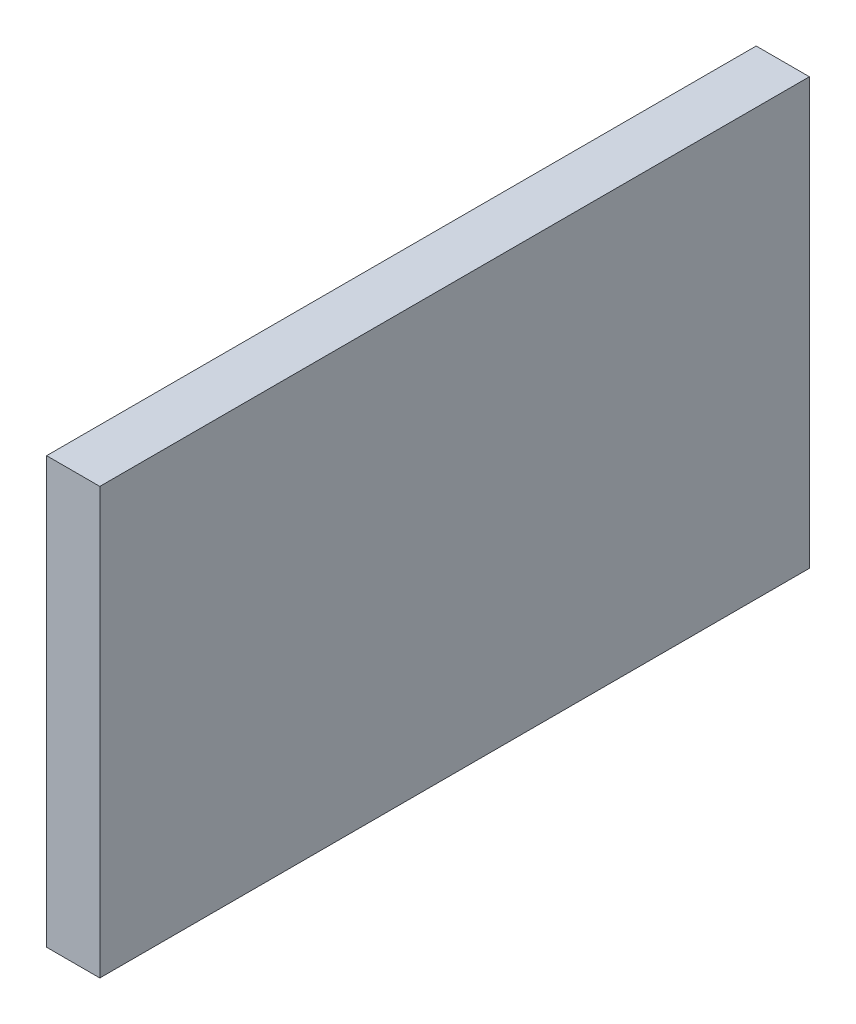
ISO-10303-21;
HEADER;
FILE_DESCRIPTION(('STEP AP214'),'2;1');
FILE_NAME('part.step','',(''),(''),'','','');
FILE_SCHEMA(('AUTOMOTIVE_DESIGN { 1 0 10303 214 1 1 1 1 }'));
ENDSEC;
DATA;
#1=APPLICATION_CONTEXT('core data for automotive mechanical design processes');
#2=APPLICATION_PROTOCOL_DEFINITION('international standard','automotive_design',2000,#1);
#3=PRODUCT_CONTEXT('',#1,'mechanical');
#4=PRODUCT('Part','Part','',(#3));
#5=PRODUCT_RELATED_PRODUCT_CATEGORY('part','',(#4));
#6=PRODUCT_DEFINITION_FORMATION('','',#4);
#7=PRODUCT_DEFINITION_CONTEXT('part definition',#1,'design');
#8=PRODUCT_DEFINITION('design','',#6,#7);
#9=PRODUCT_DEFINITION_SHAPE('','',#8);
#10=(LENGTH_UNIT() NAMED_UNIT(*) SI_UNIT(.MILLI.,.METRE.));
#11=(NAMED_UNIT(*) PLANE_ANGLE_UNIT() SI_UNIT($,.RADIAN.));
#12=(NAMED_UNIT(*) SI_UNIT($,.STERADIAN.) SOLID_ANGLE_UNIT());
#13=UNCERTAINTY_MEASURE_WITH_UNIT(LENGTH_MEASURE(1.E-05),#10,'distance_accuracy_value','');
#14=(GEOMETRIC_REPRESENTATION_CONTEXT(3) GLOBAL_UNCERTAINTY_ASSIGNED_CONTEXT((#13)) GLOBAL_UNIT_ASSIGNED_CONTEXT((#10,
#11,#12)) REPRESENTATION_CONTEXT('',''));
#15=CARTESIAN_POINT('',(0.,0.,0.));
#16=DIRECTION('',(0.,0.,1.));
#17=DIRECTION('',(1.,0.,0.));
#18=AXIS2_PLACEMENT_3D('',#15,#16,#17);
#19=CARTESIAN_POINT('',(15.,-120.,-200.));
#20=DIRECTION('',(0.,0.,1.));
#21=DIRECTION('',(1.,0.,0.));
#22=AXIS2_PLACEMENT_3D('',#19,#20,#21);
#23=PLANE('',#22);
#24=DIRECTION('',(0.,1.,0.));
#25=VECTOR('',#24,1.);
#26=CARTESIAN_POINT('',(-15.,-120.,-200.));
#27=LINE('',#26,#25);
#28=CARTESIAN_POINT('',(-15.,-120.,-200.));
#29=VERTEX_POINT('',#28);
#30=CARTESIAN_POINT('',(-15.,120.,-200.));
#31=VERTEX_POINT('',#30);
#32=EDGE_CURVE('E95',#29,#31,#27,.T.);
#33=ORIENTED_EDGE('',*,*,#32,.T.);
#34=DIRECTION('',(-1.,0.,0.));
#35=VECTOR('',#34,1.);
#36=CARTESIAN_POINT('',(15.,120.,-200.));
#37=LINE('',#36,#35);
#38=CARTESIAN_POINT('',(15.,120.,-200.));
#39=VERTEX_POINT('',#38);
#40=EDGE_CURVE('E11',#39,#31,#37,.T.);
#41=ORIENTED_EDGE('',*,*,#40,.F.);
#42=DIRECTION('',(0.,1.,0.));
#43=VECTOR('',#42,1.);
#44=CARTESIAN_POINT('',(15.,-120.,-200.));
#45=LINE('',#44,#43);
#46=CARTESIAN_POINT('',(15.,-120.,-200.));
#47=VERTEX_POINT('',#46);
#48=EDGE_CURVE('E83',#47,#39,#45,.T.);
#49=ORIENTED_EDGE('',*,*,#48,.F.);
#50=DIRECTION('',(-1.,0.,0.));
#51=VECTOR('',#50,1.);
#52=CARTESIAN_POINT('',(15.,-120.,-200.));
#53=LINE('',#52,#51);
#54=EDGE_CURVE('E91',#47,#29,#53,.T.);
#55=ORIENTED_EDGE('',*,*,#54,.T.);
#56=EDGE_LOOP('',(#33,#41,#49,#55));
#57=FACE_BOUND('',#56,.T.);
#58=ADVANCED_FACE('F32',(#57),#23,.F.);
#59=CARTESIAN_POINT('',(15.,120.,200.));
#60=DIRECTION('',(0.,-1.,0.));
#61=DIRECTION('',(0.,0.,-1.));
#62=AXIS2_PLACEMENT_3D('',#59,#60,#61);
#63=PLANE('',#62);
#64=DIRECTION('',(0.,0.,1.));
#65=VECTOR('',#64,1.);
#66=CARTESIAN_POINT('',(-15.,120.,200.));
#67=LINE('',#66,#65);
#68=CARTESIAN_POINT('',(-15.,120.,200.));
#69=VERTEX_POINT('',#68);
#70=EDGE_CURVE('E87',#31,#69,#67,.T.);
#71=ORIENTED_EDGE('',*,*,#70,.T.);
#72=DIRECTION('',(-1.,0.,0.));
#73=VECTOR('',#72,1.);
#74=CARTESIAN_POINT('',(15.,120.,200.));
#75=LINE('',#74,#73);
#76=CARTESIAN_POINT('',(15.,120.,200.));
#77=VERTEX_POINT('',#76);
#78=EDGE_CURVE('E40',#77,#69,#75,.T.);
#79=ORIENTED_EDGE('',*,*,#78,.F.);
#80=DIRECTION('',(0.,0.,1.));
#81=VECTOR('',#80,1.);
#82=CARTESIAN_POINT('',(15.,120.,200.));
#83=LINE('',#82,#81);
#84=EDGE_CURVE('E78',#39,#77,#83,.T.);
#85=ORIENTED_EDGE('',*,*,#84,.F.);
#86=ORIENTED_EDGE('',*,*,#40,.T.);
#87=EDGE_LOOP('',(#71,#79,#85,#86));
#88=FACE_BOUND('',#87,.T.);
#89=ADVANCED_FACE('F86',(#88),#63,.F.);
#90=CARTESIAN_POINT('',(15.,-120.,200.));
#91=DIRECTION('',(0.,0.,-1.));
#92=DIRECTION('',(-1.,0.,0.));
#93=AXIS2_PLACEMENT_3D('',#90,#91,#92);
#94=PLANE('',#93);
#95=DIRECTION('',(0.,-1.,0.));
#96=VECTOR('',#95,1.);
#97=CARTESIAN_POINT('',(-15.,-120.,200.));
#98=LINE('',#97,#96);
#99=CARTESIAN_POINT('',(-15.,-120.,200.));
#100=VERTEX_POINT('',#99);
#101=EDGE_CURVE('E65',#69,#100,#98,.T.);
#102=ORIENTED_EDGE('',*,*,#101,.T.);
#103=DIRECTION('',(-1.,0.,0.));
#104=VECTOR('',#103,1.);
#105=CARTESIAN_POINT('',(15.,-120.,200.));
#106=LINE('',#105,#104);
#107=CARTESIAN_POINT('',(15.,-120.,200.));
#108=VERTEX_POINT('',#107);
#109=EDGE_CURVE('E88',#108,#100,#106,.T.);
#110=ORIENTED_EDGE('',*,*,#109,.F.);
#111=DIRECTION('',(0.,-1.,0.));
#112=VECTOR('',#111,1.);
#113=CARTESIAN_POINT('',(15.,-120.,200.));
#114=LINE('',#113,#112);
#115=EDGE_CURVE('E81',#77,#108,#114,.T.);
#116=ORIENTED_EDGE('',*,*,#115,.F.);
#117=ORIENTED_EDGE('',*,*,#78,.T.);
#118=EDGE_LOOP('',(#102,#110,#116,#117));
#119=FACE_BOUND('',#118,.T.);
#120=ADVANCED_FACE('F89',(#119),#94,.F.);
#121=CARTESIAN_POINT('',(15.,-120.,200.));
#122=DIRECTION('',(0.,1.,0.));
#123=DIRECTION('',(0.,0.,1.));
#124=AXIS2_PLACEMENT_3D('',#121,#122,#123);
#125=PLANE('',#124);
#126=DIRECTION('',(0.,0.,-1.));
#127=VECTOR('',#126,1.);
#128=CARTESIAN_POINT('',(-15.,-120.,200.));
#129=LINE('',#128,#127);
#130=EDGE_CURVE('E71',#100,#29,#129,.T.);
#131=ORIENTED_EDGE('',*,*,#130,.T.);
#132=ORIENTED_EDGE('',*,*,#54,.F.);
#133=DIRECTION('',(0.,0.,-1.));
#134=VECTOR('',#133,1.);
#135=CARTESIAN_POINT('',(15.,-120.,200.));
#136=LINE('',#135,#134);
#137=EDGE_CURVE('E48',#108,#47,#136,.T.);
#138=ORIENTED_EDGE('',*,*,#137,.F.);
#139=ORIENTED_EDGE('',*,*,#109,.T.);
#140=EDGE_LOOP('',(#131,#132,#138,#139));
#141=FACE_BOUND('',#140,.T.);
#142=ADVANCED_FACE('F102',(#141),#125,.F.);
#143=CARTESIAN_POINT('',(15.,0.,0.));
#144=DIRECTION('',(-1.,0.,0.));
#145=DIRECTION('',(0.,0.,1.));
#146=AXIS2_PLACEMENT_3D('',#143,#144,#145);
#147=PLANE('',#146);
#148=ORIENTED_EDGE('',*,*,#48,.T.);
#149=ORIENTED_EDGE('',*,*,#84,.T.);
#150=ORIENTED_EDGE('',*,*,#115,.T.);
#151=ORIENTED_EDGE('',*,*,#137,.T.);
#152=EDGE_LOOP('',(#148,#149,#150,#151));
#153=FACE_BOUND('',#152,.T.);
#154=ADVANCED_FACE('F79',(#153),#147,.F.);
#155=CARTESIAN_POINT('',(-15.,0.,0.));
#156=DIRECTION('',(-1.,0.,0.));
#157=DIRECTION('',(0.,0.,1.));
#158=AXIS2_PLACEMENT_3D('',#155,#156,#157);
#159=PLANE('',#158);
#160=ORIENTED_EDGE('',*,*,#32,.F.);
#161=ORIENTED_EDGE('',*,*,#130,.F.);
#162=ORIENTED_EDGE('',*,*,#101,.F.);
#163=ORIENTED_EDGE('',*,*,#70,.F.);
#164=EDGE_LOOP('',(#160,#161,#162,#163));
#165=FACE_BOUND('',#164,.T.);
#166=ADVANCED_FACE('F105',(#165),#159,.T.);
#167=CLOSED_SHELL('',(#58,#89,#120,#142,#154,#166));
#168=MANIFOLD_SOLID_BREP('B2',#167);
#169=ADVANCED_BREP_SHAPE_REPRESENTATION('',(#18,#168),#14);
#170=SHAPE_DEFINITION_REPRESENTATION(#9,#169);
ENDSEC;
END-ISO-10303-21;
